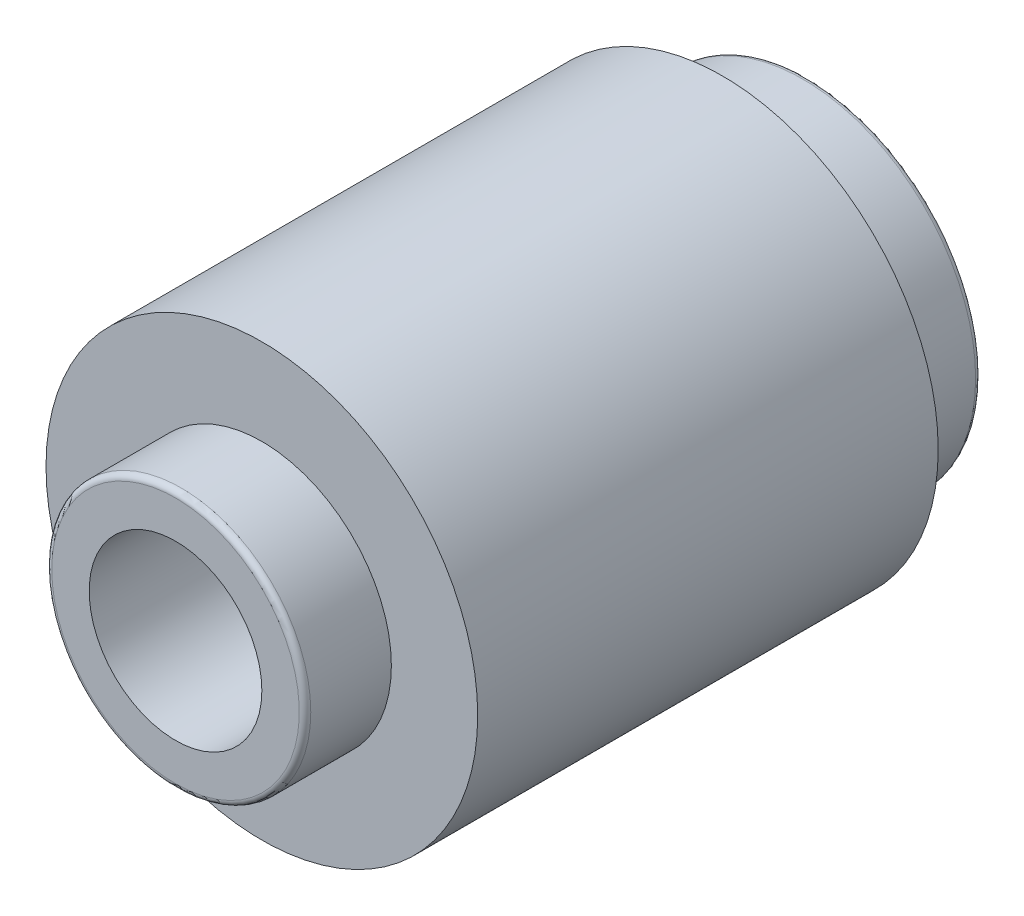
from build123d import *

# Parameters (mm, degrees)
CONG_1_R = 0.1


with BuildPart() as part:
    # Esquisse2 → Base-R_volution (revolve)
    with BuildSketch(Plane(origin=(0, 0, 0), x_dir=(0, 0, -1), z_dir=(1, 0, 0)), mode=Mode.PRIVATE) as base_r_volution_sk:
        Polygon((-3.492522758, 3.75), (4.507477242, 3.75), (4.507477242, 3), (6.007477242, 3), (6.007477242, 2.25), (-2.492522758, 2.25), (-2.492522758, 1.5), (-4.992522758, 1.5), (-4.992522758, 2.25), (-3.492522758, 2.25), align=None)
    revolve(base_r_volution_sk.sketch.rotate(Axis((0, 0, 21.361434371), (0, 0, -1)), 90), axis=Axis((0, 0, 21.361434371), (0, 0, -1)))

    # Cong_1
    cong_1_edges = [part.edges().sort_by_distance(p)[0] for p in [
        (-2.25, 0, 4.992522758),
        (-3, 0, -6.007477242),
    ]]
    fillet(cong_1_edges, radius=CONG_1_R)


solid = part.part
